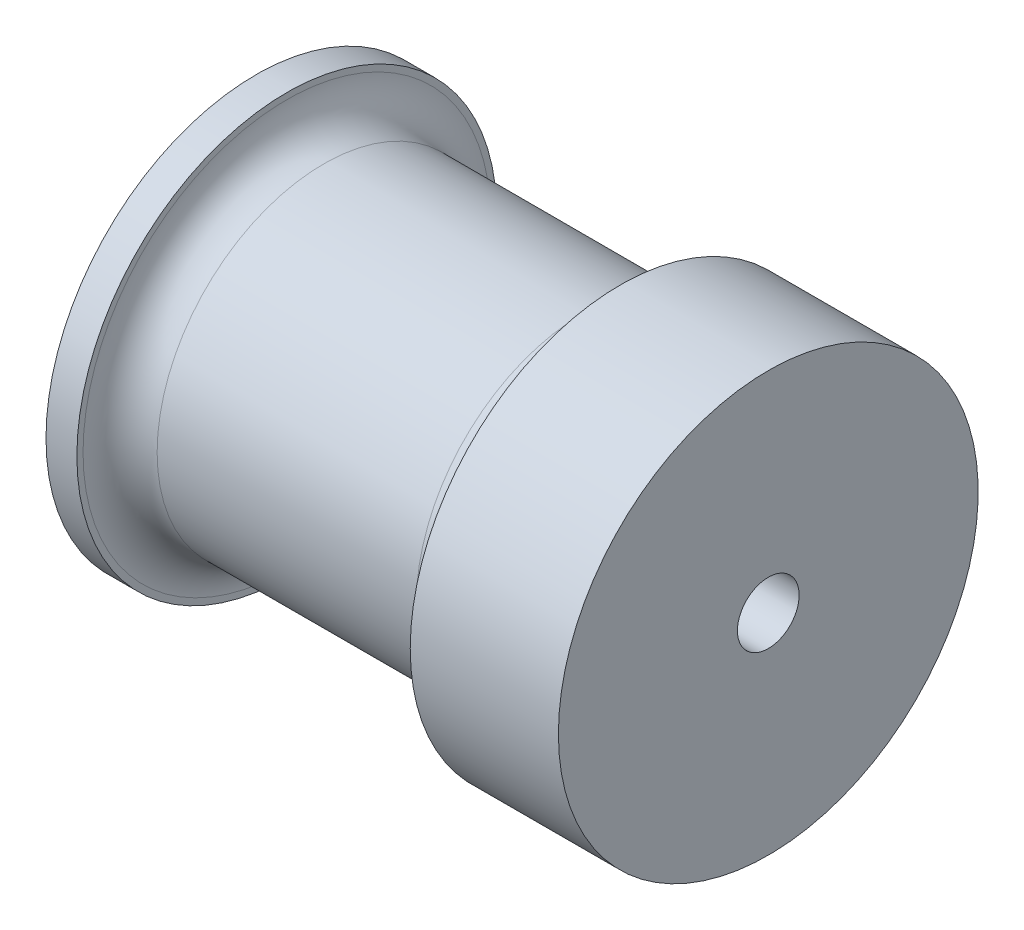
from build123d import *

# Parameters (mm, degrees)
CUT_EXTRUDE1_DEPTH      = 43.4750451
CUT_EXTRUDE1_DEPTH_BACK = 43.4750451
SKETCH2_R               = 0.9921875
FILLET13_R              = 3.81


with BuildPart() as part:
    # Sketch1 → Revolve1 (revolve)
    with BuildSketch(Plane.XY, mode=Mode.PRIVATE) as revolve1_sk:
        Polygon((-29.5275, 3.175), (-29.5275, 9.525), (-23.1775, 9.525), (-23.1775, 21.59), (-20.0025, 21.59), (-20.0025, 17.145), (14.2875, 17.145), (14.2875, 21.59), (29.5275, 21.59), (29.5275, 3.175), align=None)
    revolve(revolve1_sk.sketch.rotate(Axis((-18.073585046, 0, 0), (1, 0, 0)), 90), axis=Axis((-18.073585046, 0, 0), (1, 0, 0)))

    # Sketch2 → Cut-Extrude1 (cut, two sides: drawn at the far end of the back side and taken through both)
    with BuildSketch(Plane(origin=(0, 0, 0), x_dir=(1, 0, 0), z_dir=(0, 1, 0)).offset(-CUT_EXTRUDE1_DEPTH_BACK)):
        with Locations(Location((-26.3525, 0, 0), (0, 0, 270))):
            Circle(SKETCH2_R)
    extrude(amount=CUT_EXTRUDE1_DEPTH + CUT_EXTRUDE1_DEPTH_BACK, mode=Mode.SUBTRACT)

    # Fillet13
    fillet13_edges = [part.edges().sort_by_distance(p)[0] for p in [
        (-20.0025, 0, -17.145),
        (14.2875, 0, -17.145),
    ]]
    fillet(fillet13_edges, radius=FILLET13_R)


solid = part.part
